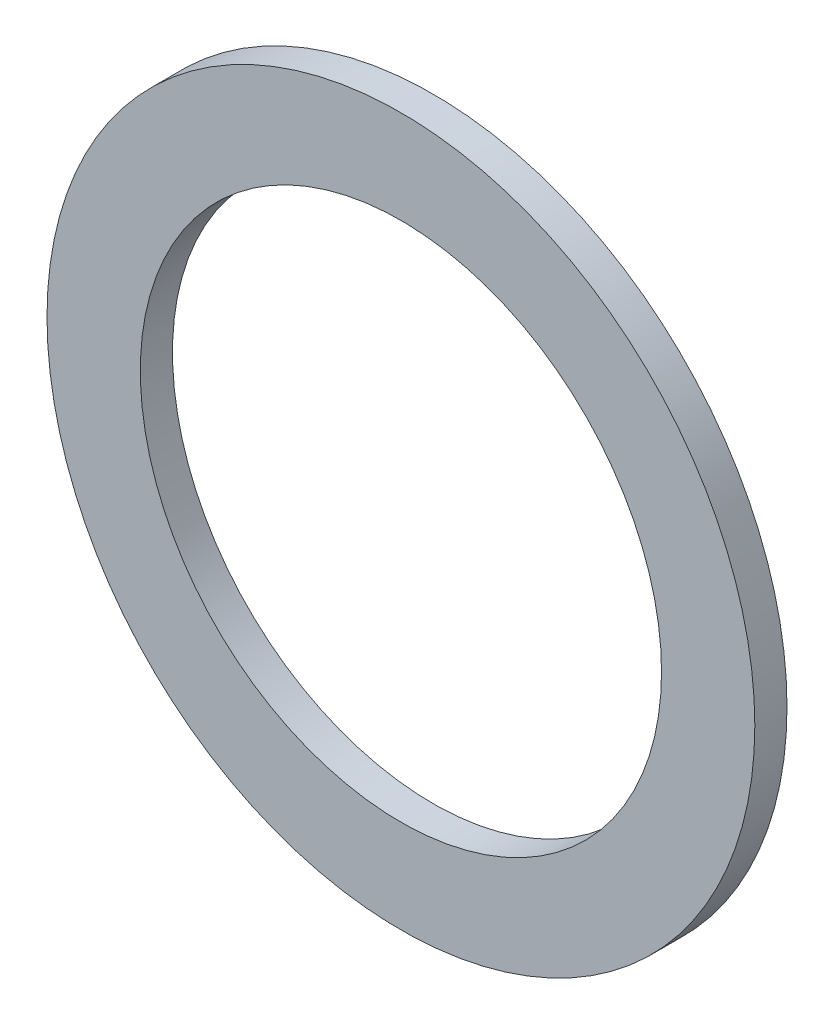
from build123d import *

# Parameters (mm, degrees)
ESQUISSE1_R      = 55
ESQUISSE1_R_2    = 40.5
EXTRUSION1_DEPTH = 5


with BuildPart() as part:
    # Esquisse1 → Extrusion1 (new body)
    with BuildSketch(Plane.XY):
        Circle(ESQUISSE1_R)
        Circle(ESQUISSE1_R_2, mode=Mode.SUBTRACT)
    extrude(amount=EXTRUSION1_DEPTH)


solid = part.part
